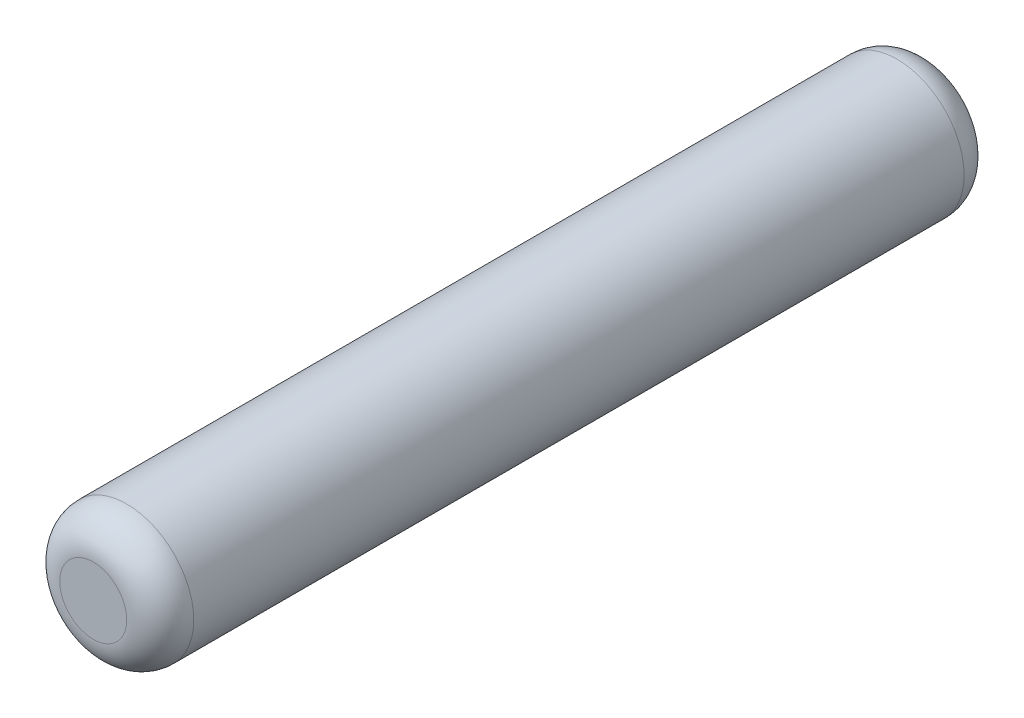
ISO-10303-21;
HEADER;
FILE_DESCRIPTION(('STEP AP214'),'2;1');
FILE_NAME('part.step','',(''),(''),'','','');
FILE_SCHEMA(('AUTOMOTIVE_DESIGN { 1 0 10303 214 1 1 1 1 }'));
ENDSEC;
DATA;
#1=APPLICATION_CONTEXT('core data for automotive mechanical design processes');
#2=APPLICATION_PROTOCOL_DEFINITION('international standard','automotive_design',2000,#1);
#3=PRODUCT_CONTEXT('',#1,'mechanical');
#4=PRODUCT('Part','Part','',(#3));
#5=PRODUCT_RELATED_PRODUCT_CATEGORY('part','',(#4));
#6=PRODUCT_DEFINITION_FORMATION('','',#4);
#7=PRODUCT_DEFINITION_CONTEXT('part definition',#1,'design');
#8=PRODUCT_DEFINITION('design','',#6,#7);
#9=PRODUCT_DEFINITION_SHAPE('','',#8);
#10=(LENGTH_UNIT() NAMED_UNIT(*) SI_UNIT(.MILLI.,.METRE.));
#11=(NAMED_UNIT(*) PLANE_ANGLE_UNIT() SI_UNIT($,.RADIAN.));
#12=(NAMED_UNIT(*) SI_UNIT($,.STERADIAN.) SOLID_ANGLE_UNIT());
#13=UNCERTAINTY_MEASURE_WITH_UNIT(LENGTH_MEASURE(1.E-05),#10,'distance_accuracy_value','');
#14=(GEOMETRIC_REPRESENTATION_CONTEXT(3) GLOBAL_UNCERTAINTY_ASSIGNED_CONTEXT((#13)) GLOBAL_UNIT_ASSIGNED_CONTEXT((#10,
#11,#12)) REPRESENTATION_CONTEXT('',''));
#15=CARTESIAN_POINT('',(0.,0.,0.));
#16=DIRECTION('',(0.,0.,1.));
#17=DIRECTION('',(1.,0.,0.));
#18=AXIS2_PLACEMENT_3D('',#15,#16,#17);
#19=CARTESIAN_POINT('',(0.,0.,12.5));
#20=DIRECTION('',(0.,0.,-1.));
#21=DIRECTION('',(-1.,0.,0.));
#22=AXIS2_PLACEMENT_3D('',#19,#20,#21);
#23=CYLINDRICAL_SURFACE('',#22,2.);
#24=CARTESIAN_POINT('',(0.,0.,-11.5));
#25=DIRECTION('',(0.,0.,1.));
#26=DIRECTION('',(1.,0.,0.));
#27=AXIS2_PLACEMENT_3D('',#24,#25,#26);
#28=CIRCLE('',#27,2.);
#29=CARTESIAN_POINT('',(2.,0.,-11.5));
#30=VERTEX_POINT('',#29);
#31=EDGE_CURVE('E43',#30,#30,#28,.T.);
#32=ORIENTED_EDGE('',*,*,#31,.T.);
#33=EDGE_LOOP('',(#32));
#34=FACE_BOUND('',#33,.T.);
#35=CARTESIAN_POINT('',(0.,0.,11.5));
#36=DIRECTION('',(0.,0.,1.));
#37=DIRECTION('',(1.,0.,0.));
#38=AXIS2_PLACEMENT_3D('',#35,#36,#37);
#39=CIRCLE('',#38,2.);
#40=CARTESIAN_POINT('',(2.,0.,11.5));
#41=VERTEX_POINT('',#40);
#42=EDGE_CURVE('E47',#41,#41,#39,.F.);
#43=ORIENTED_EDGE('',*,*,#42,.T.);
#44=EDGE_LOOP('',(#43));
#45=FACE_BOUND('',#44,.T.);
#46=ADVANCED_FACE('F32',(#34,#45),#23,.T.);
#47=CARTESIAN_POINT('',(0.,0.,12.5));
#48=DIRECTION('',(0.,0.,1.));
#49=DIRECTION('',(1.,0.,0.));
#50=AXIS2_PLACEMENT_3D('',#47,#48,#49);
#51=PLANE('',#50);
#52=CARTESIAN_POINT('',(0.,0.,12.5));
#53=DIRECTION('',(0.,0.,1.));
#54=DIRECTION('',(1.,0.,0.));
#55=AXIS2_PLACEMENT_3D('',#52,#53,#54);
#56=CIRCLE('',#55,1.);
#57=CARTESIAN_POINT('',(1.,0.,12.5));
#58=VERTEX_POINT('',#57);
#59=EDGE_CURVE('E10',#58,#58,#56,.T.);
#60=ORIENTED_EDGE('',*,*,#59,.T.);
#61=EDGE_LOOP('',(#60));
#62=FACE_BOUND('',#61,.T.);
#63=ADVANCED_FACE('F63',(#62),#51,.T.);
#64=CARTESIAN_POINT('',(0.,0.,-12.5));
#65=DIRECTION('',(0.,0.,1.));
#66=DIRECTION('',(1.,0.,0.));
#67=AXIS2_PLACEMENT_3D('',#64,#65,#66);
#68=PLANE('',#67);
#69=CARTESIAN_POINT('',(0.,0.,-12.5));
#70=DIRECTION('',(0.,0.,1.));
#71=DIRECTION('',(1.,0.,0.));
#72=AXIS2_PLACEMENT_3D('',#69,#70,#71);
#73=CIRCLE('',#72,1.);
#74=CARTESIAN_POINT('',(1.,0.,-12.5));
#75=VERTEX_POINT('',#74);
#76=EDGE_CURVE('E39',#75,#75,#73,.F.);
#77=ORIENTED_EDGE('',*,*,#76,.T.);
#78=EDGE_LOOP('',(#77));
#79=FACE_BOUND('',#78,.T.);
#80=ADVANCED_FACE('F60',(#79),#68,.F.);
#81=CARTESIAN_POINT('',(0.,0.,-11.5));
#82=DIRECTION('',(0.,0.,1.));
#83=DIRECTION('',(1.,0.,0.));
#84=AXIS2_PLACEMENT_3D('',#81,#82,#83);
#85=DEGENERATE_TOROIDAL_SURFACE('',#84,1.,1.,.T.);
#86=ORIENTED_EDGE('',*,*,#76,.F.);
#87=EDGE_LOOP('',(#86));
#88=FACE_BOUND('',#87,.T.);
#89=ORIENTED_EDGE('',*,*,#31,.F.);
#90=EDGE_LOOP('',(#89));
#91=FACE_BOUND('',#90,.T.);
#92=ADVANCED_FACE('F56',(#88,#91),#85,.T.);
#93=CARTESIAN_POINT('',(0.,0.,11.5));
#94=DIRECTION('',(0.,0.,1.));
#95=DIRECTION('',(1.,0.,0.));
#96=AXIS2_PLACEMENT_3D('',#93,#94,#95);
#97=DEGENERATE_TOROIDAL_SURFACE('',#96,1.,1.,.T.);
#98=ORIENTED_EDGE('',*,*,#42,.F.);
#99=EDGE_LOOP('',(#98));
#100=FACE_BOUND('',#99,.T.);
#101=ORIENTED_EDGE('',*,*,#59,.F.);
#102=EDGE_LOOP('',(#101));
#103=FACE_BOUND('',#102,.T.);
#104=ADVANCED_FACE('F34',(#100,#103),#97,.T.);
#105=CLOSED_SHELL('',(#46,#63,#80,#92,#104));
#106=MANIFOLD_SOLID_BREP('B2',#105);
#107=ADVANCED_BREP_SHAPE_REPRESENTATION('',(#18,#106),#14);
#108=SHAPE_DEFINITION_REPRESENTATION(#9,#107);
ENDSEC;
END-ISO-10303-21;
